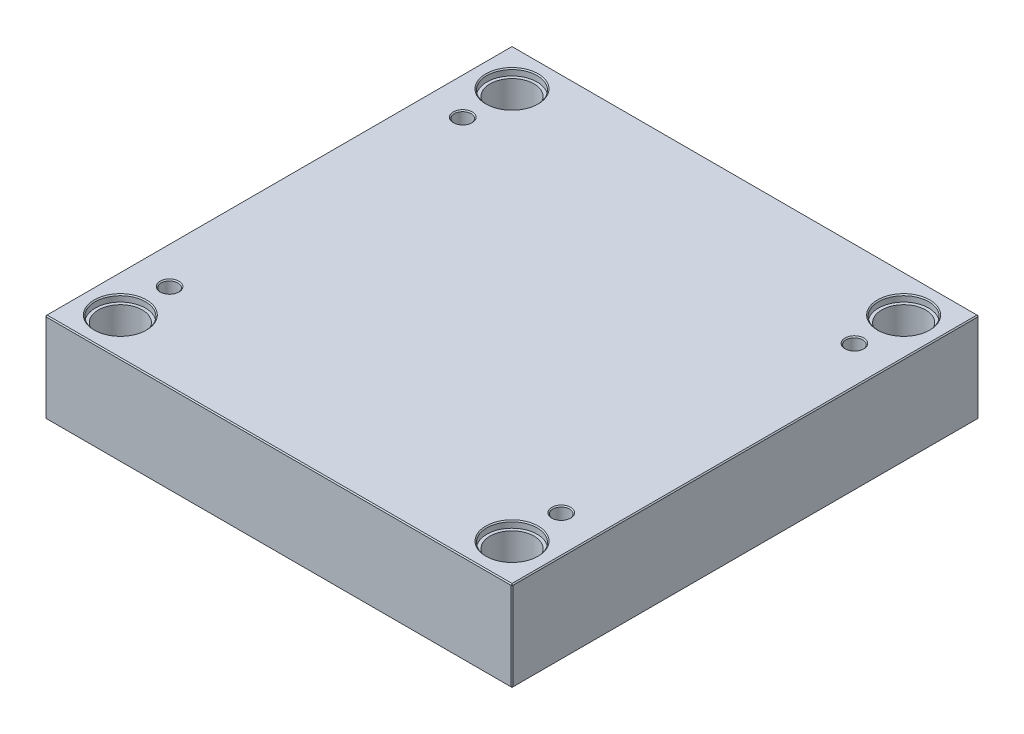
ISO-10303-21;
HEADER;
FILE_DESCRIPTION(('STEP AP214'),'2;1');
FILE_NAME('part.step','',(''),(''),'','','');
FILE_SCHEMA(('AUTOMOTIVE_DESIGN { 1 0 10303 214 1 1 1 1 }'));
ENDSEC;
DATA;
#1=APPLICATION_CONTEXT('core data for automotive mechanical design processes');
#2=APPLICATION_PROTOCOL_DEFINITION('international standard','automotive_design',2000,#1);
#3=PRODUCT_CONTEXT('',#1,'mechanical');
#4=PRODUCT('Part','Part','',(#3));
#5=PRODUCT_RELATED_PRODUCT_CATEGORY('part','',(#4));
#6=PRODUCT_DEFINITION_FORMATION('','',#4);
#7=PRODUCT_DEFINITION_CONTEXT('part definition',#1,'design');
#8=PRODUCT_DEFINITION('design','',#6,#7);
#9=PRODUCT_DEFINITION_SHAPE('','',#8);
#10=(LENGTH_UNIT() NAMED_UNIT(*) SI_UNIT(.MILLI.,.METRE.));
#11=(NAMED_UNIT(*) PLANE_ANGLE_UNIT() SI_UNIT($,.RADIAN.));
#12=(NAMED_UNIT(*) SI_UNIT($,.STERADIAN.) SOLID_ANGLE_UNIT());
#13=UNCERTAINTY_MEASURE_WITH_UNIT(LENGTH_MEASURE(1.E-05),#10,'distance_accuracy_value','');
#14=(GEOMETRIC_REPRESENTATION_CONTEXT(3) GLOBAL_UNCERTAINTY_ASSIGNED_CONTEXT((#13)) GLOBAL_UNIT_ASSIGNED_CONTEXT((#10,
#11,#12)) REPRESENTATION_CONTEXT('',''));
#15=CARTESIAN_POINT('',(0.,0.,0.));
#16=DIRECTION('',(0.,0.,1.));
#17=DIRECTION('',(1.,0.,0.));
#18=AXIS2_PLACEMENT_3D('',#15,#16,#17);
#19=CARTESIAN_POINT('',(-187.,0.,-187.));
#20=DIRECTION('',(0.,1.,0.));
#21=DIRECTION('',(0.,0.,1.));
#22=AXIS2_PLACEMENT_3D('',#19,#20,#21);
#23=CYLINDRICAL_SURFACE('',#22,21.);
#24=CARTESIAN_POINT('',(-187.,0.999999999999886,-187.));
#25=DIRECTION('',(0.,1.,0.));
#26=DIRECTION('',(0.,0.,1.));
#27=AXIS2_PLACEMENT_3D('',#24,#25,#26);
#28=CIRCLE('',#27,21.);
#29=CARTESIAN_POINT('',(-187.,0.999999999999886,-166.));
#30=VERTEX_POINT('',#29);
#31=EDGE_CURVE('E472',#30,#30,#28,.F.);
#32=ORIENTED_EDGE('',*,*,#31,.T.);
#33=EDGE_LOOP('',(#32));
#34=FACE_BOUND('',#33,.T.);
#35=CARTESIAN_POINT('',(-187.,79.7,-187.));
#36=DIRECTION('',(0.,1.,0.));
#37=DIRECTION('',(0.,0.,1.));
#38=AXIS2_PLACEMENT_3D('',#35,#36,#37);
#39=CIRCLE('',#38,21.);
#40=CARTESIAN_POINT('',(-187.,79.7,-166.));
#41=VERTEX_POINT('',#40);
#42=EDGE_CURVE('E221',#41,#41,#39,.F.);
#43=ORIENTED_EDGE('',*,*,#42,.F.);
#44=EDGE_LOOP('',(#43));
#45=FACE_BOUND('',#44,.T.);
#46=ADVANCED_FACE('F16',(#34,#45),#23,.F.);
#47=CARTESIAN_POINT('',(187.,0.,-187.));
#48=DIRECTION('',(0.,1.,0.));
#49=DIRECTION('',(0.,0.,1.));
#50=AXIS2_PLACEMENT_3D('',#47,#48,#49);
#51=CYLINDRICAL_SURFACE('',#50,21.);
#52=CARTESIAN_POINT('',(187.,0.999999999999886,-187.));
#53=DIRECTION('',(0.,1.,0.));
#54=DIRECTION('',(0.,0.,1.));
#55=AXIS2_PLACEMENT_3D('',#52,#53,#54);
#56=CIRCLE('',#55,21.);
#57=CARTESIAN_POINT('',(187.,0.999999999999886,-166.));
#58=VERTEX_POINT('',#57);
#59=EDGE_CURVE('E474',#58,#58,#56,.F.);
#60=ORIENTED_EDGE('',*,*,#59,.T.);
#61=EDGE_LOOP('',(#60));
#62=FACE_BOUND('',#61,.T.);
#63=CARTESIAN_POINT('',(187.,79.7,-187.));
#64=DIRECTION('',(0.,1.,0.));
#65=DIRECTION('',(0.,0.,1.));
#66=AXIS2_PLACEMENT_3D('',#63,#64,#65);
#67=CIRCLE('',#66,21.);
#68=CARTESIAN_POINT('',(187.,79.7,-166.));
#69=VERTEX_POINT('',#68);
#70=EDGE_CURVE('E218',#69,#69,#67,.F.);
#71=ORIENTED_EDGE('',*,*,#70,.F.);
#72=EDGE_LOOP('',(#71));
#73=FACE_BOUND('',#72,.T.);
#74=ADVANCED_FACE('F263',(#62,#73),#51,.F.);
#75=CARTESIAN_POINT('',(187.,0.,187.));
#76=DIRECTION('',(0.,1.,0.));
#77=DIRECTION('',(0.,0.,1.));
#78=AXIS2_PLACEMENT_3D('',#75,#76,#77);
#79=CYLINDRICAL_SURFACE('',#78,21.);
#80=CARTESIAN_POINT('',(187.,0.999999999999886,187.));
#81=DIRECTION('',(0.,1.,0.));
#82=DIRECTION('',(0.,0.,1.));
#83=AXIS2_PLACEMENT_3D('',#80,#81,#82);
#84=CIRCLE('',#83,21.);
#85=CARTESIAN_POINT('',(187.,0.999999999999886,208.));
#86=VERTEX_POINT('',#85);
#87=EDGE_CURVE('E477',#86,#86,#84,.F.);
#88=ORIENTED_EDGE('',*,*,#87,.T.);
#89=EDGE_LOOP('',(#88));
#90=FACE_BOUND('',#89,.T.);
#91=CARTESIAN_POINT('',(187.,79.7,187.));
#92=DIRECTION('',(0.,1.,0.));
#93=DIRECTION('',(0.,0.,1.));
#94=AXIS2_PLACEMENT_3D('',#91,#92,#93);
#95=CIRCLE('',#94,21.);
#96=CARTESIAN_POINT('',(187.,79.7,208.));
#97=VERTEX_POINT('',#96);
#98=EDGE_CURVE('E214',#97,#97,#95,.F.);
#99=ORIENTED_EDGE('',*,*,#98,.F.);
#100=EDGE_LOOP('',(#99));
#101=FACE_BOUND('',#100,.T.);
#102=ADVANCED_FACE('F270',(#90,#101),#79,.F.);
#103=CARTESIAN_POINT('',(-187.,0.,187.));
#104=DIRECTION('',(0.,1.,0.));
#105=DIRECTION('',(0.,0.,1.));
#106=AXIS2_PLACEMENT_3D('',#103,#104,#105);
#107=CYLINDRICAL_SURFACE('',#106,21.);
#108=CARTESIAN_POINT('',(-187.,0.999999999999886,187.));
#109=DIRECTION('',(0.,1.,0.));
#110=DIRECTION('',(0.,0.,1.));
#111=AXIS2_PLACEMENT_3D('',#108,#109,#110);
#112=CIRCLE('',#111,21.);
#113=CARTESIAN_POINT('',(-187.,0.999999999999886,208.));
#114=VERTEX_POINT('',#113);
#115=EDGE_CURVE('E480',#114,#114,#112,.F.);
#116=ORIENTED_EDGE('',*,*,#115,.T.);
#117=EDGE_LOOP('',(#116));
#118=FACE_BOUND('',#117,.T.);
#119=CARTESIAN_POINT('',(-187.,79.7,187.));
#120=DIRECTION('',(0.,1.,0.));
#121=DIRECTION('',(0.,0.,1.));
#122=AXIS2_PLACEMENT_3D('',#119,#120,#121);
#123=CIRCLE('',#122,21.);
#124=CARTESIAN_POINT('',(-187.,79.7,208.));
#125=VERTEX_POINT('',#124);
#126=EDGE_CURVE('E211',#125,#125,#123,.F.);
#127=ORIENTED_EDGE('',*,*,#126,.F.);
#128=EDGE_LOOP('',(#127));
#129=FACE_BOUND('',#128,.T.);
#130=ADVANCED_FACE('F277',(#118,#129),#107,.F.);
#131=CARTESIAN_POINT('',(-223.,86.,223.));
#132=DIRECTION('',(1.,0.,0.));
#133=DIRECTION('',(0.,0.,-1.));
#134=AXIS2_PLACEMENT_3D('',#131,#132,#133);
#135=PLANE('',#134);
#136=DIRECTION('',(0.,-1.,0.));
#137=VECTOR('',#136,1.);
#138=CARTESIAN_POINT('',(-223.,86.,-222.));
#139=LINE('',#138,#137);
#140=CARTESIAN_POINT('',(-223.,85.,-222.));
#141=VERTEX_POINT('',#140);
#142=CARTESIAN_POINT('',(-223.,0.99999999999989,-222.));
#143=VERTEX_POINT('',#142);
#144=EDGE_CURVE('E487',#141,#143,#139,.T.);
#145=ORIENTED_EDGE('',*,*,#144,.T.);
#146=DIRECTION('',(0.,0.,1.));
#147=VECTOR('',#146,1.);
#148=CARTESIAN_POINT('',(-223.,0.99999999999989,223.));
#149=LINE('',#148,#147);
#150=CARTESIAN_POINT('',(-223.,0.99999999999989,222.));
#151=VERTEX_POINT('',#150);
#152=EDGE_CURVE('E490',#143,#151,#149,.T.);
#153=ORIENTED_EDGE('',*,*,#152,.T.);
#154=DIRECTION('',(0.,1.,0.));
#155=VECTOR('',#154,1.);
#156=CARTESIAN_POINT('',(-223.,86.,222.));
#157=LINE('',#156,#155);
#158=CARTESIAN_POINT('',(-223.,85.,222.));
#159=VERTEX_POINT('',#158);
#160=EDGE_CURVE('E485',#151,#159,#157,.T.);
#161=ORIENTED_EDGE('',*,*,#160,.T.);
#162=DIRECTION('',(0.,0.,-1.));
#163=VECTOR('',#162,1.);
#164=CARTESIAN_POINT('',(-223.,85.,-223.));
#165=LINE('',#164,#163);
#166=EDGE_CURVE('E483',#159,#141,#165,.T.);
#167=ORIENTED_EDGE('',*,*,#166,.T.);
#168=EDGE_LOOP('',(#145,#153,#161,#167));
#169=FACE_BOUND('',#168,.T.);
#170=ADVANCED_FACE('F298',(#169),#135,.F.);
#171=CARTESIAN_POINT('',(223.,86.,223.));
#172=DIRECTION('',(0.,0.,-1.));
#173=DIRECTION('',(-1.,0.,0.));
#174=AXIS2_PLACEMENT_3D('',#171,#172,#173);
#175=PLANE('',#174);
#176=DIRECTION('',(-1.,0.,0.));
#177=VECTOR('',#176,1.);
#178=CARTESIAN_POINT('',(-223.,85.,223.));
#179=LINE('',#178,#177);
#180=CARTESIAN_POINT('',(222.,85.,223.));
#181=VERTEX_POINT('',#180);
#182=CARTESIAN_POINT('',(-222.,85.,223.));
#183=VERTEX_POINT('',#182);
#184=EDGE_CURVE('E509',#181,#183,#179,.T.);
#185=ORIENTED_EDGE('',*,*,#184,.T.);
#186=DIRECTION('',(0.,-1.,0.));
#187=VECTOR('',#186,1.);
#188=CARTESIAN_POINT('',(-222.,86.,223.));
#189=LINE('',#188,#187);
#190=CARTESIAN_POINT('',(-222.,0.99999999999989,223.));
#191=VERTEX_POINT('',#190);
#192=EDGE_CURVE('E515',#183,#191,#189,.T.);
#193=ORIENTED_EDGE('',*,*,#192,.T.);
#194=DIRECTION('',(1.,0.,0.));
#195=VECTOR('',#194,1.);
#196=CARTESIAN_POINT('',(223.,0.99999999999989,223.));
#197=LINE('',#196,#195);
#198=CARTESIAN_POINT('',(222.,0.99999999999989,223.));
#199=VERTEX_POINT('',#198);
#200=EDGE_CURVE('E513',#191,#199,#197,.T.);
#201=ORIENTED_EDGE('',*,*,#200,.T.);
#202=DIRECTION('',(0.,1.,0.));
#203=VECTOR('',#202,1.);
#204=CARTESIAN_POINT('',(222.,86.,223.));
#205=LINE('',#204,#203);
#206=EDGE_CURVE('E511',#199,#181,#205,.T.);
#207=ORIENTED_EDGE('',*,*,#206,.T.);
#208=EDGE_LOOP('',(#185,#193,#201,#207));
#209=FACE_BOUND('',#208,.T.);
#210=ADVANCED_FACE('F294',(#209),#175,.F.);
#211=CARTESIAN_POINT('',(223.,86.,223.));
#212=DIRECTION('',(-1.,0.,0.));
#213=DIRECTION('',(0.,0.,1.));
#214=AXIS2_PLACEMENT_3D('',#211,#212,#213);
#215=PLANE('',#214);
#216=DIRECTION('',(0.,0.,-1.));
#217=VECTOR('',#216,1.);
#218=CARTESIAN_POINT('',(223.,0.99999999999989,223.));
#219=LINE('',#218,#217);
#220=CARTESIAN_POINT('',(223.,0.99999999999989,222.));
#221=VERTEX_POINT('',#220);
#222=CARTESIAN_POINT('',(223.,0.99999999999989,-222.));
#223=VERTEX_POINT('',#222);
#224=EDGE_CURVE('E504',#221,#223,#219,.T.);
#225=ORIENTED_EDGE('',*,*,#224,.T.);
#226=DIRECTION('',(0.,1.,0.));
#227=VECTOR('',#226,1.);
#228=CARTESIAN_POINT('',(223.,86.,-222.));
#229=LINE('',#228,#227);
#230=CARTESIAN_POINT('',(223.,85.,-222.));
#231=VERTEX_POINT('',#230);
#232=EDGE_CURVE('E506',#223,#231,#229,.T.);
#233=ORIENTED_EDGE('',*,*,#232,.T.);
#234=DIRECTION('',(0.,0.,1.));
#235=VECTOR('',#234,1.);
#236=CARTESIAN_POINT('',(223.,85.,223.));
#237=LINE('',#236,#235);
#238=CARTESIAN_POINT('',(223.,85.,222.));
#239=VERTEX_POINT('',#238);
#240=EDGE_CURVE('E500',#231,#239,#237,.T.);
#241=ORIENTED_EDGE('',*,*,#240,.T.);
#242=DIRECTION('',(0.,-1.,0.));
#243=VECTOR('',#242,1.);
#244=CARTESIAN_POINT('',(223.,86.,222.));
#245=LINE('',#244,#243);
#246=EDGE_CURVE('E502',#239,#221,#245,.T.);
#247=ORIENTED_EDGE('',*,*,#246,.T.);
#248=EDGE_LOOP('',(#225,#233,#241,#247));
#249=FACE_BOUND('',#248,.T.);
#250=ADVANCED_FACE('F290',(#249),#215,.F.);
#251=CARTESIAN_POINT('',(223.,86.,-223.));
#252=DIRECTION('',(0.,0.,1.));
#253=DIRECTION('',(1.,0.,0.));
#254=AXIS2_PLACEMENT_3D('',#251,#252,#253);
#255=PLANE('',#254);
#256=DIRECTION('',(0.,-1.,0.));
#257=VECTOR('',#256,1.);
#258=CARTESIAN_POINT('',(222.,86.,-223.));
#259=LINE('',#258,#257);
#260=CARTESIAN_POINT('',(222.,85.,-223.));
#261=VERTEX_POINT('',#260);
#262=CARTESIAN_POINT('',(222.,0.99999999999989,-223.));
#263=VERTEX_POINT('',#262);
#264=EDGE_CURVE('E494',#261,#263,#259,.T.);
#265=ORIENTED_EDGE('',*,*,#264,.T.);
#266=DIRECTION('',(-1.,0.,0.));
#267=VECTOR('',#266,1.);
#268=CARTESIAN_POINT('',(223.,0.99999999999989,-223.));
#269=LINE('',#268,#267);
#270=CARTESIAN_POINT('',(-222.,0.99999999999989,-223.));
#271=VERTEX_POINT('',#270);
#272=EDGE_CURVE('E138',#263,#271,#269,.T.);
#273=ORIENTED_EDGE('',*,*,#272,.T.);
#274=DIRECTION('',(0.,1.,0.));
#275=VECTOR('',#274,1.);
#276=CARTESIAN_POINT('',(-222.,86.,-223.));
#277=LINE('',#276,#275);
#278=CARTESIAN_POINT('',(-222.,85.,-223.));
#279=VERTEX_POINT('',#278);
#280=EDGE_CURVE('E496',#271,#279,#277,.T.);
#281=ORIENTED_EDGE('',*,*,#280,.T.);
#282=DIRECTION('',(1.,0.,0.));
#283=VECTOR('',#282,1.);
#284=CARTESIAN_POINT('',(223.,85.,-223.));
#285=LINE('',#284,#283);
#286=EDGE_CURVE('E492',#279,#261,#285,.T.);
#287=ORIENTED_EDGE('',*,*,#286,.T.);
#288=EDGE_LOOP('',(#265,#273,#281,#287));
#289=FACE_BOUND('',#288,.T.);
#290=ADVANCED_FACE('F282',(#289),#255,.F.);
#291=CARTESIAN_POINT('',(0.,86.,0.));
#292=DIRECTION('',(0.,1.,0.));
#293=DIRECTION('',(0.,0.,1.));
#294=AXIS2_PLACEMENT_3D('',#291,#292,#293);
#295=PLANE('',#294);
#296=CARTESIAN_POINT('',(187.,86.,187.));
#297=DIRECTION('',(0.,1.,0.));
#298=DIRECTION('',(0.,0.,1.));
#299=AXIS2_PLACEMENT_3D('',#296,#297,#298);
#300=CIRCLE('',#299,25.);
#301=CARTESIAN_POINT('',(187.,86.,212.));
#302=VERTEX_POINT('',#301);
#303=EDGE_CURVE('E236',#302,#302,#300,.F.);
#304=ORIENTED_EDGE('',*,*,#303,.T.);
#305=EDGE_LOOP('',(#304));
#306=FACE_BOUND('',#305,.T.);
#307=CARTESIAN_POINT('',(-187.,86.,187.));
#308=DIRECTION('',(0.,1.,0.));
#309=DIRECTION('',(0.,0.,1.));
#310=AXIS2_PLACEMENT_3D('',#307,#308,#309);
#311=CIRCLE('',#310,25.);
#312=CARTESIAN_POINT('',(-187.,86.,212.));
#313=VERTEX_POINT('',#312);
#314=EDGE_CURVE('E233',#313,#313,#311,.F.);
#315=ORIENTED_EDGE('',*,*,#314,.T.);
#316=EDGE_LOOP('',(#315));
#317=FACE_BOUND('',#316,.T.);
#318=CARTESIAN_POINT('',(187.,86.,-187.));
#319=DIRECTION('',(0.,1.,0.));
#320=DIRECTION('',(0.,0.,1.));
#321=AXIS2_PLACEMENT_3D('',#318,#319,#320);
#322=CIRCLE('',#321,25.);
#323=CARTESIAN_POINT('',(187.,86.,-162.));
#324=VERTEX_POINT('',#323);
#325=EDGE_CURVE('E230',#324,#324,#322,.F.);
#326=ORIENTED_EDGE('',*,*,#325,.T.);
#327=EDGE_LOOP('',(#326));
#328=FACE_BOUND('',#327,.T.);
#329=CARTESIAN_POINT('',(-187.,86.,-187.));
#330=DIRECTION('',(0.,1.,0.));
#331=DIRECTION('',(0.,0.,1.));
#332=AXIS2_PLACEMENT_3D('',#329,#330,#331);
#333=CIRCLE('',#332,25.);
#334=CARTESIAN_POINT('',(-187.,86.,-162.));
#335=VERTEX_POINT('',#334);
#336=EDGE_CURVE('E227',#335,#335,#333,.F.);
#337=ORIENTED_EDGE('',*,*,#336,.T.);
#338=EDGE_LOOP('',(#337));
#339=FACE_BOUND('',#338,.T.);
#340=CARTESIAN_POINT('',(-187.,86.,140.));
#341=DIRECTION('',(0.,1.,0.));
#342=DIRECTION('',(0.,0.,1.));
#343=AXIS2_PLACEMENT_3D('',#340,#341,#342);
#344=CIRCLE('',#343,9.);
#345=CARTESIAN_POINT('',(-187.,86.,149.));
#346=VERTEX_POINT('',#345);
#347=EDGE_CURVE('E198',#346,#346,#344,.F.);
#348=ORIENTED_EDGE('',*,*,#347,.T.);
#349=EDGE_LOOP('',(#348));
#350=FACE_BOUND('',#349,.T.);
#351=CARTESIAN_POINT('',(187.,86.,140.));
#352=DIRECTION('',(0.,1.,0.));
#353=DIRECTION('',(0.,0.,1.));
#354=AXIS2_PLACEMENT_3D('',#351,#352,#353);
#355=CIRCLE('',#354,9.);
#356=CARTESIAN_POINT('',(187.,86.,149.));
#357=VERTEX_POINT('',#356);
#358=EDGE_CURVE('E195',#357,#357,#355,.F.);
#359=ORIENTED_EDGE('',*,*,#358,.T.);
#360=EDGE_LOOP('',(#359));
#361=FACE_BOUND('',#360,.T.);
#362=CARTESIAN_POINT('',(187.,86.,-140.));
#363=DIRECTION('',(0.,1.,0.));
#364=DIRECTION('',(0.,0.,1.));
#365=AXIS2_PLACEMENT_3D('',#362,#363,#364);
#366=CIRCLE('',#365,9.);
#367=CARTESIAN_POINT('',(187.,86.,-131.));
#368=VERTEX_POINT('',#367);
#369=EDGE_CURVE('E192',#368,#368,#366,.F.);
#370=ORIENTED_EDGE('',*,*,#369,.T.);
#371=EDGE_LOOP('',(#370));
#372=FACE_BOUND('',#371,.T.);
#373=CARTESIAN_POINT('',(-187.,86.,-140.));
#374=DIRECTION('',(0.,1.,0.));
#375=DIRECTION('',(0.,0.,1.));
#376=AXIS2_PLACEMENT_3D('',#373,#374,#375);
#377=CIRCLE('',#376,8.99999999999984);
#378=CARTESIAN_POINT('',(-187.,86.,-131.));
#379=VERTEX_POINT('',#378);
#380=EDGE_CURVE('E188',#379,#379,#377,.F.);
#381=ORIENTED_EDGE('',*,*,#380,.T.);
#382=EDGE_LOOP('',(#381));
#383=FACE_BOUND('',#382,.T.);
#384=DIRECTION('',(0.,0.,-1.));
#385=VECTOR('',#384,1.);
#386=CARTESIAN_POINT('',(222.,86.,-223.));
#387=LINE('',#386,#385);
#388=CARTESIAN_POINT('',(222.,86.,222.));
#389=VERTEX_POINT('',#388);
#390=CARTESIAN_POINT('',(222.,86.,-222.));
#391=VERTEX_POINT('',#390);
#392=EDGE_CURVE('E31',#389,#391,#387,.T.);
#393=ORIENTED_EDGE('',*,*,#392,.T.);
#394=DIRECTION('',(-1.,0.,0.));
#395=VECTOR('',#394,1.);
#396=CARTESIAN_POINT('',(-223.,86.,-222.));
#397=LINE('',#396,#395);
#398=CARTESIAN_POINT('',(-222.,86.,-222.));
#399=VERTEX_POINT('',#398);
#400=EDGE_CURVE('E189',#391,#399,#397,.T.);
#401=ORIENTED_EDGE('',*,*,#400,.T.);
#402=DIRECTION('',(0.,0.,1.));
#403=VECTOR('',#402,1.);
#404=CARTESIAN_POINT('',(-222.,86.,223.));
#405=LINE('',#404,#403);
#406=CARTESIAN_POINT('',(-222.,86.,222.));
#407=VERTEX_POINT('',#406);
#408=EDGE_CURVE('E518',#399,#407,#405,.T.);
#409=ORIENTED_EDGE('',*,*,#408,.T.);
#410=DIRECTION('',(1.,0.,0.));
#411=VECTOR('',#410,1.);
#412=CARTESIAN_POINT('',(223.,86.,222.));
#413=LINE('',#412,#411);
#414=EDGE_CURVE('E36',#407,#389,#413,.T.);
#415=ORIENTED_EDGE('',*,*,#414,.T.);
#416=EDGE_LOOP('',(#393,#401,#409,#415));
#417=FACE_BOUND('',#416,.T.);
#418=ADVANCED_FACE('F279',(#306,#317,#328,#339,#350,#361,#372,#383,#417),#295,.T.);
#419=CARTESIAN_POINT('',(0.,0.,0.));
#420=DIRECTION('',(0.,1.,0.));
#421=DIRECTION('',(0.,0.,1.));
#422=AXIS2_PLACEMENT_3D('',#419,#420,#421);
#423=PLANE('',#422);
#424=CARTESIAN_POINT('',(-187.,0.,-187.));
#425=DIRECTION('',(0.,1.,0.));
#426=DIRECTION('',(0.,0.,1.));
#427=AXIS2_PLACEMENT_3D('',#424,#425,#426);
#428=CIRCLE('',#427,22.);
#429=CARTESIAN_POINT('',(-187.,0.,-165.));
#430=VERTEX_POINT('',#429);
#431=EDGE_CURVE('E469',#430,#430,#428,.T.);
#432=ORIENTED_EDGE('',*,*,#431,.T.);
#433=EDGE_LOOP('',(#432));
#434=FACE_BOUND('',#433,.T.);
#435=CARTESIAN_POINT('',(187.,0.,-187.));
#436=DIRECTION('',(0.,1.,0.));
#437=DIRECTION('',(0.,0.,1.));
#438=AXIS2_PLACEMENT_3D('',#435,#436,#437);
#439=CIRCLE('',#438,22.);
#440=CARTESIAN_POINT('',(187.,0.,-165.));
#441=VERTEX_POINT('',#440);
#442=EDGE_CURVE('E466',#441,#441,#439,.T.);
#443=ORIENTED_EDGE('',*,*,#442,.T.);
#444=EDGE_LOOP('',(#443));
#445=FACE_BOUND('',#444,.T.);
#446=CARTESIAN_POINT('',(187.,0.,187.));
#447=DIRECTION('',(0.,1.,0.));
#448=DIRECTION('',(0.,0.,1.));
#449=AXIS2_PLACEMENT_3D('',#446,#447,#448);
#450=CIRCLE('',#449,22.);
#451=CARTESIAN_POINT('',(187.,0.,209.));
#452=VERTEX_POINT('',#451);
#453=EDGE_CURVE('E463',#452,#452,#450,.T.);
#454=ORIENTED_EDGE('',*,*,#453,.T.);
#455=EDGE_LOOP('',(#454));
#456=FACE_BOUND('',#455,.T.);
#457=CARTESIAN_POINT('',(-187.,0.,187.));
#458=DIRECTION('',(0.,1.,0.));
#459=DIRECTION('',(0.,0.,1.));
#460=AXIS2_PLACEMENT_3D('',#457,#458,#459);
#461=CIRCLE('',#460,22.);
#462=CARTESIAN_POINT('',(-187.,0.,209.));
#463=VERTEX_POINT('',#462);
#464=EDGE_CURVE('E460',#463,#463,#461,.T.);
#465=ORIENTED_EDGE('',*,*,#464,.T.);
#466=EDGE_LOOP('',(#465));
#467=FACE_BOUND('',#466,.T.);
#468=DIRECTION('',(0.,0.,1.));
#469=VECTOR('',#468,1.);
#470=CARTESIAN_POINT('',(222.,0.,0.));
#471=LINE('',#470,#469);
#472=CARTESIAN_POINT('',(222.,0.,-222.));
#473=VERTEX_POINT('',#472);
#474=CARTESIAN_POINT('',(222.,0.,222.));
#475=VERTEX_POINT('',#474);
#476=EDGE_CURVE('E108',#473,#475,#471,.T.);
#477=ORIENTED_EDGE('',*,*,#476,.T.);
#478=DIRECTION('',(-1.,0.,0.));
#479=VECTOR('',#478,1.);
#480=CARTESIAN_POINT('',(0.,0.,222.));
#481=LINE('',#480,#479);
#482=CARTESIAN_POINT('',(-222.,0.,222.));
#483=VERTEX_POINT('',#482);
#484=EDGE_CURVE('E458',#475,#483,#481,.T.);
#485=ORIENTED_EDGE('',*,*,#484,.T.);
#486=DIRECTION('',(0.,0.,-1.));
#487=VECTOR('',#486,1.);
#488=CARTESIAN_POINT('',(-222.,0.,0.));
#489=LINE('',#488,#487);
#490=CARTESIAN_POINT('',(-222.,0.,-222.));
#491=VERTEX_POINT('',#490);
#492=EDGE_CURVE('E110',#483,#491,#489,.T.);
#493=ORIENTED_EDGE('',*,*,#492,.T.);
#494=DIRECTION('',(1.,0.,0.));
#495=VECTOR('',#494,1.);
#496=CARTESIAN_POINT('',(0.,0.,-222.));
#497=LINE('',#496,#495);
#498=EDGE_CURVE('E104',#491,#473,#497,.T.);
#499=ORIENTED_EDGE('',*,*,#498,.T.);
#500=EDGE_LOOP('',(#477,#485,#493,#499));
#501=FACE_BOUND('',#500,.T.);
#502=ADVANCED_FACE('F106',(#434,#445,#456,#467,#501),#423,.F.);
#503=CARTESIAN_POINT('',(-187.,0.,-187.));
#504=DIRECTION('',(0.,-1.,0.));
#505=DIRECTION('',(0.,0.,-1.));
#506=AXIS2_PLACEMENT_3D('',#503,#504,#505);
#507=CONICAL_SURFACE('',#506,22.,0.78539816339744);
#508=ORIENTED_EDGE('',*,*,#31,.F.);
#509=EDGE_LOOP('',(#508));
#510=FACE_BOUND('',#509,.T.);
#511=ORIENTED_EDGE('',*,*,#431,.F.);
#512=EDGE_LOOP('',(#511));
#513=FACE_BOUND('',#512,.T.);
#514=ADVANCED_FACE('F286',(#510,#513),#507,.F.);
#515=CARTESIAN_POINT('',(187.,0.,-187.));
#516=DIRECTION('',(0.,-1.,0.));
#517=DIRECTION('',(0.,0.,-1.));
#518=AXIS2_PLACEMENT_3D('',#515,#516,#517);
#519=CONICAL_SURFACE('',#518,22.,0.78539816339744);
#520=ORIENTED_EDGE('',*,*,#59,.F.);
#521=EDGE_LOOP('',(#520));
#522=FACE_BOUND('',#521,.T.);
#523=ORIENTED_EDGE('',*,*,#442,.F.);
#524=EDGE_LOOP('',(#523));
#525=FACE_BOUND('',#524,.T.);
#526=ADVANCED_FACE('F305',(#522,#525),#519,.F.);
#527=CARTESIAN_POINT('',(187.,0.,187.));
#528=DIRECTION('',(0.,-1.,0.));
#529=DIRECTION('',(0.,0.,-1.));
#530=AXIS2_PLACEMENT_3D('',#527,#528,#529);
#531=CONICAL_SURFACE('',#530,22.,0.78539816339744);
#532=ORIENTED_EDGE('',*,*,#87,.F.);
#533=EDGE_LOOP('',(#532));
#534=FACE_BOUND('',#533,.T.);
#535=ORIENTED_EDGE('',*,*,#453,.F.);
#536=EDGE_LOOP('',(#535));
#537=FACE_BOUND('',#536,.T.);
#538=ADVANCED_FACE('F309',(#534,#537),#531,.F.);
#539=CARTESIAN_POINT('',(-187.,0.,187.));
#540=DIRECTION('',(0.,-1.,0.));
#541=DIRECTION('',(0.,0.,-1.));
#542=AXIS2_PLACEMENT_3D('',#539,#540,#541);
#543=CONICAL_SURFACE('',#542,22.,0.78539816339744);
#544=ORIENTED_EDGE('',*,*,#115,.F.);
#545=EDGE_LOOP('',(#544));
#546=FACE_BOUND('',#545,.T.);
#547=ORIENTED_EDGE('',*,*,#464,.F.);
#548=EDGE_LOOP('',(#547));
#549=FACE_BOUND('',#548,.T.);
#550=ADVANCED_FACE('F313',(#546,#549),#543,.F.);
#551=CARTESIAN_POINT('',(223.,86.,222.));
#552=DIRECTION('',(-0.707106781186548,0.,-0.707106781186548));
#553=DIRECTION('',(0.,-1.,0.));
#554=AXIS2_PLACEMENT_3D('',#551,#552,#553);
#555=PLANE('',#554);
#556=DIRECTION('',(-0.707106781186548,0.,0.707106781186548));
#557=VECTOR('',#556,1.);
#558=CARTESIAN_POINT('',(222.,85.,223.));
#559=LINE('',#558,#557);
#560=EDGE_CURVE('E126',#181,#239,#559,.F.);
#561=ORIENTED_EDGE('',*,*,#560,.F.);
#562=ORIENTED_EDGE('',*,*,#206,.F.);
#563=DIRECTION('',(0.707106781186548,0.,-0.707106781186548));
#564=VECTOR('',#563,1.);
#565=CARTESIAN_POINT('',(222.,0.99999999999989,223.));
#566=LINE('',#565,#564);
#567=EDGE_CURVE('E180',#221,#199,#566,.F.);
#568=ORIENTED_EDGE('',*,*,#567,.F.);
#569=ORIENTED_EDGE('',*,*,#246,.F.);
#570=EDGE_LOOP('',(#561,#562,#568,#569));
#571=FACE_BOUND('',#570,.T.);
#572=ADVANCED_FACE('F317',(#571),#555,.F.);
#573=CARTESIAN_POINT('',(222.,85.,223.));
#574=DIRECTION('',(0.577350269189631,0.577350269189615,0.577350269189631));
#575=DIRECTION('',(0.707106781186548,0.,-0.707106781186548));
#576=AXIS2_PLACEMENT_3D('',#573,#574,#575);
#577=PLANE('',#576);
#578=DIRECTION('',(0.,-0.707106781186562,0.707106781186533));
#579=VECTOR('',#578,1.);
#580=CARTESIAN_POINT('',(222.,85.,223.));
#581=LINE('',#580,#579);
#582=EDGE_CURVE('E175',#181,#389,#581,.F.);
#583=ORIENTED_EDGE('',*,*,#582,.F.);
#584=ORIENTED_EDGE('',*,*,#560,.T.);
#585=DIRECTION('',(-0.707106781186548,0.707106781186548,0.));
#586=VECTOR('',#585,1.);
#587=CARTESIAN_POINT('',(222.5,85.5,222.));
#588=LINE('',#587,#586);
#589=EDGE_CURVE('E177',#389,#239,#588,.F.);
#590=ORIENTED_EDGE('',*,*,#589,.F.);
#591=EDGE_LOOP('',(#583,#584,#590));
#592=FACE_BOUND('',#591,.T.);
#593=ADVANCED_FACE('F385',(#592),#577,.T.);
#594=CARTESIAN_POINT('',(222.,0.99999999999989,223.));
#595=DIRECTION('',(0.577350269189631,-0.577350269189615,0.577350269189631));
#596=DIRECTION('',(0.707106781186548,0.,-0.707106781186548));
#597=AXIS2_PLACEMENT_3D('',#594,#595,#596);
#598=PLANE('',#597);
#599=DIRECTION('',(-0.707106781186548,-0.707106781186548,0.));
#600=VECTOR('',#599,1.);
#601=CARTESIAN_POINT('',(222.5,0.499999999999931,222.));
#602=LINE('',#601,#600);
#603=EDGE_CURVE('E124',#221,#475,#602,.T.);
#604=ORIENTED_EDGE('',*,*,#603,.F.);
#605=ORIENTED_EDGE('',*,*,#567,.T.);
#606=DIRECTION('',(0.,0.707106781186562,0.707106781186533));
#607=VECTOR('',#606,1.);
#608=CARTESIAN_POINT('',(222.,0.99999999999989,223.));
#609=LINE('',#608,#607);
#610=EDGE_CURVE('E172',#475,#199,#609,.T.);
#611=ORIENTED_EDGE('',*,*,#610,.F.);
#612=EDGE_LOOP('',(#604,#605,#611));
#613=FACE_BOUND('',#612,.T.);
#614=ADVANCED_FACE('F381',(#613),#598,.T.);
#615=CARTESIAN_POINT('',(222.,86.,0.));
#616=DIRECTION('',(0.707106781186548,0.707106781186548,0.));
#617=DIRECTION('',(0.,0.,1.));
#618=AXIS2_PLACEMENT_3D('',#615,#616,#617);
#619=PLANE('',#618);
#620=ORIENTED_EDGE('',*,*,#589,.T.);
#621=ORIENTED_EDGE('',*,*,#240,.F.);
#622=DIRECTION('',(0.707106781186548,-0.707106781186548,0.));
#623=VECTOR('',#622,1.);
#624=CARTESIAN_POINT('',(223.,85.,-222.));
#625=LINE('',#624,#623);
#626=EDGE_CURVE('E166',#391,#231,#625,.T.);
#627=ORIENTED_EDGE('',*,*,#626,.F.);
#628=ORIENTED_EDGE('',*,*,#392,.F.);
#629=EDGE_LOOP('',(#620,#621,#627,#628));
#630=FACE_BOUND('',#629,.T.);
#631=ADVANCED_FACE('F377',(#630),#619,.T.);
#632=CARTESIAN_POINT('',(0.,86.,222.));
#633=DIRECTION('',(0.,0.707106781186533,0.707106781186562));
#634=DIRECTION('',(-1.,0.,0.));
#635=AXIS2_PLACEMENT_3D('',#632,#633,#634);
#636=PLANE('',#635);
#637=ORIENTED_EDGE('',*,*,#582,.T.);
#638=ORIENTED_EDGE('',*,*,#414,.F.);
#639=DIRECTION('',(0.,0.707106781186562,-0.707106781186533));
#640=VECTOR('',#639,1.);
#641=CARTESIAN_POINT('',(-222.,85.5,222.5));
#642=LINE('',#641,#640);
#643=EDGE_CURVE('E163',#183,#407,#642,.T.);
#644=ORIENTED_EDGE('',*,*,#643,.F.);
#645=ORIENTED_EDGE('',*,*,#184,.F.);
#646=EDGE_LOOP('',(#637,#638,#644,#645));
#647=FACE_BOUND('',#646,.T.);
#648=ADVANCED_FACE('F373',(#647),#636,.T.);
#649=CARTESIAN_POINT('',(-222.,86.,223.));
#650=DIRECTION('',(0.707106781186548,0.,-0.707106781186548));
#651=DIRECTION('',(0.,-1.,0.));
#652=AXIS2_PLACEMENT_3D('',#649,#650,#651);
#653=PLANE('',#652);
#654=DIRECTION('',(0.707106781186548,0.,0.707106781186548));
#655=VECTOR('',#654,1.);
#656=CARTESIAN_POINT('',(-222.,0.99999999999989,223.));
#657=LINE('',#656,#655);
#658=EDGE_CURVE('E157',#191,#151,#657,.F.);
#659=ORIENTED_EDGE('',*,*,#658,.F.);
#660=ORIENTED_EDGE('',*,*,#192,.F.);
#661=DIRECTION('',(-0.707106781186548,0.,-0.707106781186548));
#662=VECTOR('',#661,1.);
#663=CARTESIAN_POINT('',(-223.,85.,222.));
#664=LINE('',#663,#662);
#665=EDGE_CURVE('E160',#159,#183,#664,.F.);
#666=ORIENTED_EDGE('',*,*,#665,.F.);
#667=ORIENTED_EDGE('',*,*,#160,.F.);
#668=EDGE_LOOP('',(#659,#660,#666,#667));
#669=FACE_BOUND('',#668,.T.);
#670=ADVANCED_FACE('F369',(#669),#653,.F.);
#671=CARTESIAN_POINT('',(223.,0.99999999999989,223.));
#672=DIRECTION('',(0.,0.707106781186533,-0.707106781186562));
#673=DIRECTION('',(1.,0.,0.));
#674=AXIS2_PLACEMENT_3D('',#671,#672,#673);
#675=PLANE('',#674);
#676=ORIENTED_EDGE('',*,*,#610,.T.);
#677=ORIENTED_EDGE('',*,*,#200,.F.);
#678=DIRECTION('',(0.,-0.707106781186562,-0.707106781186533));
#679=VECTOR('',#678,1.);
#680=CARTESIAN_POINT('',(-222.,0.99999999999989,223.));
#681=LINE('',#680,#679);
#682=EDGE_CURVE('E135',#483,#191,#681,.F.);
#683=ORIENTED_EDGE('',*,*,#682,.F.);
#684=ORIENTED_EDGE('',*,*,#484,.F.);
#685=EDGE_LOOP('',(#676,#677,#683,#684));
#686=FACE_BOUND('',#685,.T.);
#687=ADVANCED_FACE('F366',(#686),#675,.F.);
#688=CARTESIAN_POINT('',(223.,0.99999999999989,223.));
#689=DIRECTION('',(-0.707106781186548,0.707106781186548,0.));
#690=DIRECTION('',(0.,0.,-1.));
#691=AXIS2_PLACEMENT_3D('',#688,#689,#690);
#692=PLANE('',#691);
#693=ORIENTED_EDGE('',*,*,#603,.T.);
#694=ORIENTED_EDGE('',*,*,#476,.F.);
#695=DIRECTION('',(0.707106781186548,0.707106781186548,0.));
#696=VECTOR('',#695,1.);
#697=CARTESIAN_POINT('',(222.5,0.499999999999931,-222.));
#698=LINE('',#697,#696);
#699=EDGE_CURVE('E121',#223,#473,#698,.F.);
#700=ORIENTED_EDGE('',*,*,#699,.F.);
#701=ORIENTED_EDGE('',*,*,#224,.F.);
#702=EDGE_LOOP('',(#693,#694,#700,#701));
#703=FACE_BOUND('',#702,.T.);
#704=ADVANCED_FACE('F119',(#703),#692,.F.);
#705=CARTESIAN_POINT('',(222.,86.,-223.));
#706=DIRECTION('',(-0.707106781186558,0.,0.707106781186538));
#707=DIRECTION('',(0.,-1.,0.));
#708=AXIS2_PLACEMENT_3D('',#705,#706,#707);
#709=PLANE('',#708);
#710=DIRECTION('',(0.707106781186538,0.,0.707106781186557));
#711=VECTOR('',#710,1.);
#712=CARTESIAN_POINT('',(223.,85.,-222.));
#713=LINE('',#712,#711);
#714=EDGE_CURVE('E168',#231,#261,#713,.F.);
#715=ORIENTED_EDGE('',*,*,#714,.F.);
#716=ORIENTED_EDGE('',*,*,#232,.F.);
#717=DIRECTION('',(-0.707106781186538,0.,-0.707106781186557));
#718=VECTOR('',#717,1.);
#719=CARTESIAN_POINT('',(222.,0.99999999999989,-223.));
#720=LINE('',#719,#718);
#721=EDGE_CURVE('E134',#263,#223,#720,.F.);
#722=ORIENTED_EDGE('',*,*,#721,.F.);
#723=ORIENTED_EDGE('',*,*,#264,.F.);
#724=EDGE_LOOP('',(#715,#716,#722,#723));
#725=FACE_BOUND('',#724,.T.);
#726=ADVANCED_FACE('F359',(#725),#709,.F.);
#727=CARTESIAN_POINT('',(223.,85.,-222.));
#728=DIRECTION('',(0.577350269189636,0.57735026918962,-0.57735026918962));
#729=DIRECTION('',(-0.707106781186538,0.,-0.707106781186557));
#730=AXIS2_PLACEMENT_3D('',#727,#728,#729);
#731=PLANE('',#730);
#732=ORIENTED_EDGE('',*,*,#626,.T.);
#733=ORIENTED_EDGE('',*,*,#714,.T.);
#734=DIRECTION('',(0.,0.707106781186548,0.707106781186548));
#735=VECTOR('',#734,1.);
#736=CARTESIAN_POINT('',(222.,85.5,-222.5));
#737=LINE('',#736,#735);
#738=EDGE_CURVE('E152',#391,#261,#737,.F.);
#739=ORIENTED_EDGE('',*,*,#738,.F.);
#740=EDGE_LOOP('',(#732,#733,#739));
#741=FACE_BOUND('',#740,.T.);
#742=ADVANCED_FACE('F355',(#741),#731,.T.);
#743=CARTESIAN_POINT('',(-223.,85.,222.));
#744=DIRECTION('',(-0.577350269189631,0.577350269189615,0.577350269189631));
#745=DIRECTION('',(0.707106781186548,0.,0.707106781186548));
#746=AXIS2_PLACEMENT_3D('',#743,#744,#745);
#747=PLANE('',#746);
#748=ORIENTED_EDGE('',*,*,#665,.T.);
#749=ORIENTED_EDGE('',*,*,#643,.T.);
#750=DIRECTION('',(-0.707106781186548,-0.707106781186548,0.));
#751=VECTOR('',#750,1.);
#752=CARTESIAN_POINT('',(-223.,85.,222.));
#753=LINE('',#752,#751);
#754=EDGE_CURVE('E143',#159,#407,#753,.F.);
#755=ORIENTED_EDGE('',*,*,#754,.F.);
#756=EDGE_LOOP('',(#748,#749,#755));
#757=FACE_BOUND('',#756,.T.);
#758=ADVANCED_FACE('F351',(#757),#747,.T.);
#759=CARTESIAN_POINT('',(-222.,0.99999999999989,223.));
#760=DIRECTION('',(-0.577350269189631,-0.577350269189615,0.577350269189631));
#761=DIRECTION('',(0.707106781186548,0.,0.707106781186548));
#762=AXIS2_PLACEMENT_3D('',#759,#760,#761);
#763=PLANE('',#762);
#764=ORIENTED_EDGE('',*,*,#682,.T.);
#765=ORIENTED_EDGE('',*,*,#658,.T.);
#766=DIRECTION('',(-0.707106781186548,0.707106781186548,0.));
#767=VECTOR('',#766,1.);
#768=CARTESIAN_POINT('',(-222.5,0.499999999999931,222.));
#769=LINE('',#768,#767);
#770=EDGE_CURVE('E139',#483,#151,#769,.T.);
#771=ORIENTED_EDGE('',*,*,#770,.F.);
#772=EDGE_LOOP('',(#764,#765,#771));
#773=FACE_BOUND('',#772,.T.);
#774=ADVANCED_FACE('F348',(#773),#763,.T.);
#775=CARTESIAN_POINT('',(222.,0.99999999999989,-223.));
#776=DIRECTION('',(0.577350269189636,-0.57735026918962,-0.57735026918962));
#777=DIRECTION('',(-0.707106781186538,0.,-0.707106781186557));
#778=AXIS2_PLACEMENT_3D('',#775,#776,#777);
#779=PLANE('',#778);
#780=ORIENTED_EDGE('',*,*,#721,.T.);
#781=ORIENTED_EDGE('',*,*,#699,.T.);
#782=DIRECTION('',(0.,-0.707106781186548,0.707106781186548));
#783=VECTOR('',#782,1.);
#784=CARTESIAN_POINT('',(222.,0.99999999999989,-223.));
#785=LINE('',#784,#783);
#786=EDGE_CURVE('E131',#263,#473,#785,.T.);
#787=ORIENTED_EDGE('',*,*,#786,.F.);
#788=EDGE_LOOP('',(#780,#781,#787));
#789=FACE_BOUND('',#788,.T.);
#790=ADVANCED_FACE('F130',(#789),#779,.T.);
#791=CARTESIAN_POINT('',(0.,86.,-222.));
#792=DIRECTION('',(0.,0.707106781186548,-0.707106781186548));
#793=DIRECTION('',(1.,0.,0.));
#794=AXIS2_PLACEMENT_3D('',#791,#792,#793);
#795=PLANE('',#794);
#796=ORIENTED_EDGE('',*,*,#738,.T.);
#797=ORIENTED_EDGE('',*,*,#286,.F.);
#798=DIRECTION('',(0.,-0.707106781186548,-0.707106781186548));
#799=VECTOR('',#798,1.);
#800=CARTESIAN_POINT('',(-222.,85.,-223.));
#801=LINE('',#800,#799);
#802=EDGE_CURVE('E140',#399,#279,#801,.T.);
#803=ORIENTED_EDGE('',*,*,#802,.F.);
#804=ORIENTED_EDGE('',*,*,#400,.F.);
#805=EDGE_LOOP('',(#796,#797,#803,#804));
#806=FACE_BOUND('',#805,.T.);
#807=ADVANCED_FACE('F341',(#806),#795,.T.);
#808=CARTESIAN_POINT('',(-222.,86.,0.));
#809=DIRECTION('',(-0.707106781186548,0.707106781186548,0.));
#810=DIRECTION('',(0.,0.,-1.));
#811=AXIS2_PLACEMENT_3D('',#808,#809,#810);
#812=PLANE('',#811);
#813=ORIENTED_EDGE('',*,*,#754,.T.);
#814=ORIENTED_EDGE('',*,*,#408,.F.);
#815=DIRECTION('',(0.707106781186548,0.707106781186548,0.));
#816=VECTOR('',#815,1.);
#817=CARTESIAN_POINT('',(-222.5,85.5,-222.));
#818=LINE('',#817,#816);
#819=EDGE_CURVE('E146',#141,#399,#818,.T.);
#820=ORIENTED_EDGE('',*,*,#819,.F.);
#821=ORIENTED_EDGE('',*,*,#166,.F.);
#822=EDGE_LOOP('',(#813,#814,#820,#821));
#823=FACE_BOUND('',#822,.T.);
#824=ADVANCED_FACE('F337',(#823),#812,.T.);
#825=CARTESIAN_POINT('',(-223.,0.99999999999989,223.));
#826=DIRECTION('',(0.707106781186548,0.707106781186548,0.));
#827=DIRECTION('',(0.,0.,1.));
#828=AXIS2_PLACEMENT_3D('',#825,#826,#827);
#829=PLANE('',#828);
#830=ORIENTED_EDGE('',*,*,#770,.T.);
#831=ORIENTED_EDGE('',*,*,#152,.F.);
#832=DIRECTION('',(0.707106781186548,-0.707106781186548,0.));
#833=VECTOR('',#832,1.);
#834=CARTESIAN_POINT('',(-223.,0.99999999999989,-222.));
#835=LINE('',#834,#833);
#836=EDGE_CURVE('E529',#491,#143,#835,.F.);
#837=ORIENTED_EDGE('',*,*,#836,.F.);
#838=ORIENTED_EDGE('',*,*,#492,.F.);
#839=EDGE_LOOP('',(#830,#831,#837,#838));
#840=FACE_BOUND('',#839,.T.);
#841=ADVANCED_FACE('F334',(#840),#829,.F.);
#842=CARTESIAN_POINT('',(223.,0.99999999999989,-223.));
#843=DIRECTION('',(0.,0.707106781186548,0.707106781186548));
#844=DIRECTION('',(-1.,0.,0.));
#845=AXIS2_PLACEMENT_3D('',#842,#843,#844);
#846=PLANE('',#845);
#847=ORIENTED_EDGE('',*,*,#786,.T.);
#848=ORIENTED_EDGE('',*,*,#498,.F.);
#849=DIRECTION('',(0.,0.707106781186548,-0.707106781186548));
#850=VECTOR('',#849,1.);
#851=CARTESIAN_POINT('',(-222.,0.499999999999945,-222.5));
#852=LINE('',#851,#850);
#853=EDGE_CURVE('E526',#271,#491,#852,.F.);
#854=ORIENTED_EDGE('',*,*,#853,.F.);
#855=ORIENTED_EDGE('',*,*,#272,.F.);
#856=EDGE_LOOP('',(#847,#848,#854,#855));
#857=FACE_BOUND('',#856,.T.);
#858=ADVANCED_FACE('F137',(#857),#846,.F.);
#859=CARTESIAN_POINT('',(-222.,85.,-223.));
#860=DIRECTION('',(-0.577350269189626,0.577350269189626,-0.577350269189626));
#861=DIRECTION('',(-0.707106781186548,0.,0.707106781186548));
#862=AXIS2_PLACEMENT_3D('',#859,#860,#861);
#863=PLANE('',#862);
#864=ORIENTED_EDGE('',*,*,#819,.T.);
#865=ORIENTED_EDGE('',*,*,#802,.T.);
#866=DIRECTION('',(0.707106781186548,0.,-0.707106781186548));
#867=VECTOR('',#866,1.);
#868=CARTESIAN_POINT('',(-222.,85.,-223.));
#869=LINE('',#868,#867);
#870=EDGE_CURVE('E524',#141,#279,#869,.T.);
#871=ORIENTED_EDGE('',*,*,#870,.F.);
#872=EDGE_LOOP('',(#864,#865,#871));
#873=FACE_BOUND('',#872,.T.);
#874=ADVANCED_FACE('F327',(#873),#863,.T.);
#875=CARTESIAN_POINT('',(-223.,0.99999999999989,-222.));
#876=DIRECTION('',(-0.577350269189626,-0.577350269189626,-0.577350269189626));
#877=DIRECTION('',(-0.707106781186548,0.,0.707106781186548));
#878=AXIS2_PLACEMENT_3D('',#875,#876,#877);
#879=PLANE('',#878);
#880=ORIENTED_EDGE('',*,*,#853,.T.);
#881=ORIENTED_EDGE('',*,*,#836,.T.);
#882=DIRECTION('',(-0.707106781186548,0.,0.707106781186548));
#883=VECTOR('',#882,1.);
#884=CARTESIAN_POINT('',(-223.,0.99999999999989,-222.));
#885=LINE('',#884,#883);
#886=EDGE_CURVE('E455',#271,#143,#885,.T.);
#887=ORIENTED_EDGE('',*,*,#886,.F.);
#888=EDGE_LOOP('',(#880,#881,#887));
#889=FACE_BOUND('',#888,.T.);
#890=ADVANCED_FACE('F323',(#889),#879,.T.);
#891=CARTESIAN_POINT('',(-223.,86.,-222.));
#892=DIRECTION('',(0.707106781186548,0.,0.707106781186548));
#893=DIRECTION('',(0.,-1.,0.));
#894=AXIS2_PLACEMENT_3D('',#891,#892,#893);
#895=PLANE('',#894);
#896=ORIENTED_EDGE('',*,*,#870,.T.);
#897=ORIENTED_EDGE('',*,*,#280,.F.);
#898=ORIENTED_EDGE('',*,*,#886,.T.);
#899=ORIENTED_EDGE('',*,*,#144,.F.);
#900=EDGE_LOOP('',(#896,#897,#898,#899));
#901=FACE_BOUND('',#900,.T.);
#902=ADVANCED_FACE('F319',(#901),#895,.F.);
#903=CARTESIAN_POINT('',(-187.,61.,-140.));
#904=DIRECTION('',(0.,1.,0.));
#905=DIRECTION('',(0.,0.,1.));
#906=AXIS2_PLACEMENT_3D('',#903,#904,#905);
#907=CYLINDRICAL_SURFACE('',#906,8.);
#908=CARTESIAN_POINT('',(-187.,85.,-140.));
#909=DIRECTION('',(0.,1.,0.));
#910=DIRECTION('',(0.,0.,1.));
#911=AXIS2_PLACEMENT_3D('',#908,#909,#910);
#912=CIRCLE('',#911,8.);
#913=CARTESIAN_POINT('',(-187.,85.,-132.));
#914=VERTEX_POINT('',#913);
#915=EDGE_CURVE('E207',#914,#914,#912,.T.);
#916=ORIENTED_EDGE('',*,*,#915,.T.);
#917=EDGE_LOOP('',(#916));
#918=FACE_BOUND('',#917,.T.);
#919=CARTESIAN_POINT('',(-187.,61.,-140.));
#920=DIRECTION('',(0.,1.,0.));
#921=DIRECTION('',(0.,0.,1.));
#922=AXIS2_PLACEMENT_3D('',#919,#920,#921);
#923=CIRCLE('',#922,8.);
#924=CARTESIAN_POINT('',(-187.,61.,-132.));
#925=VERTEX_POINT('',#924);
#926=EDGE_CURVE('E448',#925,#925,#923,.T.);
#927=ORIENTED_EDGE('',*,*,#926,.F.);
#928=EDGE_LOOP('',(#927));
#929=FACE_BOUND('',#928,.T.);
#930=ADVANCED_FACE('F322',(#918,#929),#907,.F.);
#931=CARTESIAN_POINT('',(-187.,61.,-140.));
#932=DIRECTION('',(0.,1.,0.));
#933=DIRECTION('',(0.,0.,1.));
#934=AXIS2_PLACEMENT_3D('',#931,#932,#933);
#935=PLANE('',#934);
#936=ORIENTED_EDGE('',*,*,#926,.T.);
#937=EDGE_LOOP('',(#936));
#938=FACE_BOUND('',#937,.T.);
#939=ADVANCED_FACE('F596',(#938),#935,.T.);
#940=CARTESIAN_POINT('',(187.,61.,-140.));
#941=DIRECTION('',(0.,1.,0.));
#942=DIRECTION('',(0.,0.,1.));
#943=AXIS2_PLACEMENT_3D('',#940,#941,#942);
#944=CYLINDRICAL_SURFACE('',#943,8.);
#945=CARTESIAN_POINT('',(187.,85.,-140.));
#946=DIRECTION('',(0.,1.,0.));
#947=DIRECTION('',(0.,0.,1.));
#948=AXIS2_PLACEMENT_3D('',#945,#946,#947);
#949=CIRCLE('',#948,8.);
#950=CARTESIAN_POINT('',(187.,85.,-132.));
#951=VERTEX_POINT('',#950);
#952=EDGE_CURVE('E204',#951,#951,#949,.T.);
#953=ORIENTED_EDGE('',*,*,#952,.T.);
#954=EDGE_LOOP('',(#953));
#955=FACE_BOUND('',#954,.T.);
#956=CARTESIAN_POINT('',(187.,61.,-140.));
#957=DIRECTION('',(0.,1.,0.));
#958=DIRECTION('',(0.,0.,1.));
#959=AXIS2_PLACEMENT_3D('',#956,#957,#958);
#960=CIRCLE('',#959,8.);
#961=CARTESIAN_POINT('',(187.,61.,-132.));
#962=VERTEX_POINT('',#961);
#963=EDGE_CURVE('E445',#962,#962,#960,.T.);
#964=ORIENTED_EDGE('',*,*,#963,.F.);
#965=EDGE_LOOP('',(#964));
#966=FACE_BOUND('',#965,.T.);
#967=ADVANCED_FACE('F592',(#955,#966),#944,.F.);
#968=CARTESIAN_POINT('',(187.,61.,-140.));
#969=DIRECTION('',(0.,1.,0.));
#970=DIRECTION('',(0.,0.,1.));
#971=AXIS2_PLACEMENT_3D('',#968,#969,#970);
#972=PLANE('',#971);
#973=ORIENTED_EDGE('',*,*,#963,.T.);
#974=EDGE_LOOP('',(#973));
#975=FACE_BOUND('',#974,.T.);
#976=ADVANCED_FACE('F588',(#975),#972,.T.);
#977=CARTESIAN_POINT('',(187.,61.,140.));
#978=DIRECTION('',(0.,1.,0.));
#979=DIRECTION('',(0.,0.,1.));
#980=AXIS2_PLACEMENT_3D('',#977,#978,#979);
#981=CYLINDRICAL_SURFACE('',#980,8.);
#982=CARTESIAN_POINT('',(187.,85.,140.));
#983=DIRECTION('',(0.,1.,0.));
#984=DIRECTION('',(0.,0.,1.));
#985=AXIS2_PLACEMENT_3D('',#982,#983,#984);
#986=CIRCLE('',#985,8.);
#987=CARTESIAN_POINT('',(187.,85.,148.));
#988=VERTEX_POINT('',#987);
#989=EDGE_CURVE('E201',#988,#988,#986,.T.);
#990=ORIENTED_EDGE('',*,*,#989,.T.);
#991=EDGE_LOOP('',(#990));
#992=FACE_BOUND('',#991,.T.);
#993=CARTESIAN_POINT('',(187.,61.,140.));
#994=DIRECTION('',(0.,1.,0.));
#995=DIRECTION('',(0.,0.,1.));
#996=AXIS2_PLACEMENT_3D('',#993,#994,#995);
#997=CIRCLE('',#996,8.);
#998=CARTESIAN_POINT('',(187.,61.,148.));
#999=VERTEX_POINT('',#998);
#1000=EDGE_CURVE('E449',#999,#999,#997,.T.);
#1001=ORIENTED_EDGE('',*,*,#1000,.F.);
#1002=EDGE_LOOP('',(#1001));
#1003=FACE_BOUND('',#1002,.T.);
#1004=ADVANCED_FACE('F591',(#992,#1003),#981,.F.);
#1005=CARTESIAN_POINT('',(187.,61.,140.));
#1006=DIRECTION('',(0.,1.,0.));
#1007=DIRECTION('',(0.,0.,1.));
#1008=AXIS2_PLACEMENT_3D('',#1005,#1006,#1007);
#1009=PLANE('',#1008);
#1010=ORIENTED_EDGE('',*,*,#1000,.T.);
#1011=EDGE_LOOP('',(#1010));
#1012=FACE_BOUND('',#1011,.T.);
#1013=ADVANCED_FACE('F598',(#1012),#1009,.T.);
#1014=CARTESIAN_POINT('',(-187.,61.,140.));
#1015=DIRECTION('',(0.,1.,0.));
#1016=DIRECTION('',(0.,0.,1.));
#1017=AXIS2_PLACEMENT_3D('',#1014,#1015,#1016);
#1018=CYLINDRICAL_SURFACE('',#1017,8.);
#1019=CARTESIAN_POINT('',(-187.,85.,140.));
#1020=DIRECTION('',(0.,1.,0.));
#1021=DIRECTION('',(0.,0.,1.));
#1022=AXIS2_PLACEMENT_3D('',#1019,#1020,#1021);
#1023=CIRCLE('',#1022,8.);
#1024=CARTESIAN_POINT('',(-187.,85.,148.));
#1025=VERTEX_POINT('',#1024);
#1026=EDGE_CURVE('E185',#1025,#1025,#1023,.T.);
#1027=ORIENTED_EDGE('',*,*,#1026,.T.);
#1028=EDGE_LOOP('',(#1027));
#1029=FACE_BOUND('',#1028,.T.);
#1030=CARTESIAN_POINT('',(-187.,61.,140.));
#1031=DIRECTION('',(0.,1.,0.));
#1032=DIRECTION('',(0.,0.,1.));
#1033=AXIS2_PLACEMENT_3D('',#1030,#1031,#1032);
#1034=CIRCLE('',#1033,8.);
#1035=CARTESIAN_POINT('',(-187.,61.,148.));
#1036=VERTEX_POINT('',#1035);
#1037=EDGE_CURVE('E224',#1036,#1036,#1034,.T.);
#1038=ORIENTED_EDGE('',*,*,#1037,.F.);
#1039=EDGE_LOOP('',(#1038));
#1040=FACE_BOUND('',#1039,.T.);
#1041=ADVANCED_FACE('F601',(#1029,#1040),#1018,.F.);
#1042=CARTESIAN_POINT('',(-187.,61.,140.));
#1043=DIRECTION('',(0.,1.,0.));
#1044=DIRECTION('',(0.,0.,1.));
#1045=AXIS2_PLACEMENT_3D('',#1042,#1043,#1044);
#1046=PLANE('',#1045);
#1047=ORIENTED_EDGE('',*,*,#1037,.T.);
#1048=EDGE_LOOP('',(#1047));
#1049=FACE_BOUND('',#1048,.T.);
#1050=ADVANCED_FACE('F397',(#1049),#1046,.T.);
#1051=CARTESIAN_POINT('',(-187.,85.,140.));
#1052=DIRECTION('',(0.,1.,0.));
#1053=DIRECTION('',(0.,0.,1.));
#1054=AXIS2_PLACEMENT_3D('',#1051,#1052,#1053);
#1055=CONICAL_SURFACE('',#1054,8.,0.785398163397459);
#1056=ORIENTED_EDGE('',*,*,#347,.F.);
#1057=EDGE_LOOP('',(#1056));
#1058=FACE_BOUND('',#1057,.T.);
#1059=ORIENTED_EDGE('',*,*,#1026,.F.);
#1060=EDGE_LOOP('',(#1059));
#1061=FACE_BOUND('',#1060,.T.);
#1062=ADVANCED_FACE('F393',(#1058,#1061),#1055,.F.);
#1063=CARTESIAN_POINT('',(187.,85.,140.));
#1064=DIRECTION('',(0.,1.,0.));
#1065=DIRECTION('',(0.,0.,1.));
#1066=AXIS2_PLACEMENT_3D('',#1063,#1064,#1065);
#1067=CONICAL_SURFACE('',#1066,8.,0.785398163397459);
#1068=ORIENTED_EDGE('',*,*,#358,.F.);
#1069=EDGE_LOOP('',(#1068));
#1070=FACE_BOUND('',#1069,.T.);
#1071=ORIENTED_EDGE('',*,*,#989,.F.);
#1072=EDGE_LOOP('',(#1071));
#1073=FACE_BOUND('',#1072,.T.);
#1074=ADVANCED_FACE('F396',(#1070,#1073),#1067,.F.);
#1075=CARTESIAN_POINT('',(187.,85.,-140.));
#1076=DIRECTION('',(0.,1.,0.));
#1077=DIRECTION('',(0.,0.,1.));
#1078=AXIS2_PLACEMENT_3D('',#1075,#1076,#1077);
#1079=CONICAL_SURFACE('',#1078,8.,0.785398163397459);
#1080=ORIENTED_EDGE('',*,*,#369,.F.);
#1081=EDGE_LOOP('',(#1080));
#1082=FACE_BOUND('',#1081,.T.);
#1083=ORIENTED_EDGE('',*,*,#952,.F.);
#1084=EDGE_LOOP('',(#1083));
#1085=FACE_BOUND('',#1084,.T.);
#1086=ADVANCED_FACE('F401',(#1082,#1085),#1079,.F.);
#1087=CARTESIAN_POINT('',(-187.,85.,-140.));
#1088=DIRECTION('',(0.,1.,0.));
#1089=DIRECTION('',(0.,0.,1.));
#1090=AXIS2_PLACEMENT_3D('',#1087,#1088,#1089);
#1091=CONICAL_SURFACE('',#1090,8.,0.785398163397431);
#1092=ORIENTED_EDGE('',*,*,#380,.F.);
#1093=EDGE_LOOP('',(#1092));
#1094=FACE_BOUND('',#1093,.T.);
#1095=ORIENTED_EDGE('',*,*,#915,.F.);
#1096=EDGE_LOOP('',(#1095));
#1097=FACE_BOUND('',#1096,.T.);
#1098=ADVANCED_FACE('F405',(#1094,#1097),#1091,.F.);
#1099=CARTESIAN_POINT('',(-187.,79.7,187.));
#1100=DIRECTION('',(0.,1.,0.));
#1101=DIRECTION('',(0.,0.,1.));
#1102=AXIS2_PLACEMENT_3D('',#1099,#1100,#1101);
#1103=PLANE('',#1102);
#1104=CARTESIAN_POINT('',(-187.,79.7,187.));
#1105=DIRECTION('',(0.,1.,0.));
#1106=DIRECTION('',(0.,0.,1.));
#1107=AXIS2_PLACEMENT_3D('',#1104,#1105,#1106);
#1108=CIRCLE('',#1107,24.);
#1109=CARTESIAN_POINT('',(-187.,79.7,211.));
#1110=VERTEX_POINT('',#1109);
#1111=EDGE_CURVE('E436',#1110,#1110,#1108,.T.);
#1112=ORIENTED_EDGE('',*,*,#1111,.T.);
#1113=EDGE_LOOP('',(#1112));
#1114=FACE_BOUND('',#1113,.T.);
#1115=ORIENTED_EDGE('',*,*,#126,.T.);
#1116=EDGE_LOOP('',(#1115));
#1117=FACE_BOUND('',#1116,.T.);
#1118=ADVANCED_FACE('F409',(#1114,#1117),#1103,.T.);
#1119=CARTESIAN_POINT('',(-187.,79.7,187.));
#1120=DIRECTION('',(0.,1.,0.));
#1121=DIRECTION('',(0.,0.,1.));
#1122=AXIS2_PLACEMENT_3D('',#1119,#1120,#1121);
#1123=CYLINDRICAL_SURFACE('',#1122,24.);
#1124=CARTESIAN_POINT('',(-187.,85.,187.));
#1125=DIRECTION('',(0.,1.,0.));
#1126=DIRECTION('',(0.,0.,1.));
#1127=AXIS2_PLACEMENT_3D('',#1124,#1125,#1126);
#1128=CIRCLE('',#1127,24.);
#1129=CARTESIAN_POINT('',(-187.,85.,211.));
#1130=VERTEX_POINT('',#1129);
#1131=EDGE_CURVE('E239',#1130,#1130,#1128,.T.);
#1132=ORIENTED_EDGE('',*,*,#1131,.T.);
#1133=EDGE_LOOP('',(#1132));
#1134=FACE_BOUND('',#1133,.T.);
#1135=ORIENTED_EDGE('',*,*,#1111,.F.);
#1136=EDGE_LOOP('',(#1135));
#1137=FACE_BOUND('',#1136,.T.);
#1138=ADVANCED_FACE('F574',(#1134,#1137),#1123,.F.);
#1139=CARTESIAN_POINT('',(187.,79.7,187.));
#1140=DIRECTION('',(0.,1.,0.));
#1141=DIRECTION('',(0.,0.,1.));
#1142=AXIS2_PLACEMENT_3D('',#1139,#1140,#1141);
#1143=PLANE('',#1142);
#1144=CARTESIAN_POINT('',(187.,79.7,187.));
#1145=DIRECTION('',(0.,1.,0.));
#1146=DIRECTION('',(0.,0.,1.));
#1147=AXIS2_PLACEMENT_3D('',#1144,#1145,#1146);
#1148=CIRCLE('',#1147,24.);
#1149=CARTESIAN_POINT('',(187.,79.7,211.));
#1150=VERTEX_POINT('',#1149);
#1151=EDGE_CURVE('E433',#1150,#1150,#1148,.T.);
#1152=ORIENTED_EDGE('',*,*,#1151,.T.);
#1153=EDGE_LOOP('',(#1152));
#1154=FACE_BOUND('',#1153,.T.);
#1155=ORIENTED_EDGE('',*,*,#98,.T.);
#1156=EDGE_LOOP('',(#1155));
#1157=FACE_BOUND('',#1156,.T.);
#1158=ADVANCED_FACE('F429',(#1154,#1157),#1143,.T.);
#1159=CARTESIAN_POINT('',(187.,79.7,187.));
#1160=DIRECTION('',(0.,1.,0.));
#1161=DIRECTION('',(0.,0.,1.));
#1162=AXIS2_PLACEMENT_3D('',#1159,#1160,#1161);
#1163=CYLINDRICAL_SURFACE('',#1162,24.);
#1164=CARTESIAN_POINT('',(187.,85.,187.));
#1165=DIRECTION('',(0.,1.,0.));
#1166=DIRECTION('',(0.,0.,1.));
#1167=AXIS2_PLACEMENT_3D('',#1164,#1165,#1166);
#1168=CIRCLE('',#1167,24.);
#1169=CARTESIAN_POINT('',(187.,85.,211.));
#1170=VERTEX_POINT('',#1169);
#1171=EDGE_CURVE('E210',#1170,#1170,#1168,.T.);
#1172=ORIENTED_EDGE('',*,*,#1171,.T.);
#1173=EDGE_LOOP('',(#1172));
#1174=FACE_BOUND('',#1173,.T.);
#1175=ORIENTED_EDGE('',*,*,#1151,.F.);
#1176=EDGE_LOOP('',(#1175));
#1177=FACE_BOUND('',#1176,.T.);
#1178=ADVANCED_FACE('F425',(#1174,#1177),#1163,.F.);
#1179=CARTESIAN_POINT('',(187.,79.7,-187.));
#1180=DIRECTION('',(0.,1.,0.));
#1181=DIRECTION('',(0.,0.,1.));
#1182=AXIS2_PLACEMENT_3D('',#1179,#1180,#1181);
#1183=PLANE('',#1182);
#1184=CARTESIAN_POINT('',(187.,79.7,-187.));
#1185=DIRECTION('',(0.,1.,0.));
#1186=DIRECTION('',(0.,0.,1.));
#1187=AXIS2_PLACEMENT_3D('',#1184,#1185,#1186);
#1188=CIRCLE('',#1187,24.);
#1189=CARTESIAN_POINT('',(187.,79.7,-163.));
#1190=VERTEX_POINT('',#1189);
#1191=EDGE_CURVE('E435',#1190,#1190,#1188,.T.);
#1192=ORIENTED_EDGE('',*,*,#1191,.T.);
#1193=EDGE_LOOP('',(#1192));
#1194=FACE_BOUND('',#1193,.T.);
#1195=ORIENTED_EDGE('',*,*,#70,.T.);
#1196=EDGE_LOOP('',(#1195));
#1197=FACE_BOUND('',#1196,.T.);
#1198=ADVANCED_FACE('F428',(#1194,#1197),#1183,.T.);
#1199=CARTESIAN_POINT('',(187.,79.7,-187.));
#1200=DIRECTION('',(0.,1.,0.));
#1201=DIRECTION('',(0.,0.,1.));
#1202=AXIS2_PLACEMENT_3D('',#1199,#1200,#1201);
#1203=CYLINDRICAL_SURFACE('',#1202,24.);
#1204=CARTESIAN_POINT('',(187.,85.,-187.));
#1205=DIRECTION('',(0.,1.,0.));
#1206=DIRECTION('',(0.,0.,1.));
#1207=AXIS2_PLACEMENT_3D('',#1204,#1205,#1206);
#1208=CIRCLE('',#1207,24.);
#1209=CARTESIAN_POINT('',(187.,85.,-163.));
#1210=VERTEX_POINT('',#1209);
#1211=EDGE_CURVE('E24',#1210,#1210,#1208,.T.);
#1212=ORIENTED_EDGE('',*,*,#1211,.T.);
#1213=EDGE_LOOP('',(#1212));
#1214=FACE_BOUND('',#1213,.T.);
#1215=ORIENTED_EDGE('',*,*,#1191,.F.);
#1216=EDGE_LOOP('',(#1215));
#1217=FACE_BOUND('',#1216,.T.);
#1218=ADVANCED_FACE('F244',(#1214,#1217),#1203,.F.);
#1219=CARTESIAN_POINT('',(-187.,79.7,-187.));
#1220=DIRECTION('',(0.,1.,0.));
#1221=DIRECTION('',(0.,0.,1.));
#1222=AXIS2_PLACEMENT_3D('',#1219,#1220,#1221);
#1223=PLANE('',#1222);
#1224=CARTESIAN_POINT('',(-187.,79.7,-187.));
#1225=DIRECTION('',(0.,1.,0.));
#1226=DIRECTION('',(0.,0.,1.));
#1227=AXIS2_PLACEMENT_3D('',#1224,#1225,#1226);
#1228=CIRCLE('',#1227,24.);
#1229=CARTESIAN_POINT('',(-187.,79.7,-163.));
#1230=VERTEX_POINT('',#1229);
#1231=EDGE_CURVE('E215',#1230,#1230,#1228,.T.);
#1232=ORIENTED_EDGE('',*,*,#1231,.T.);
#1233=EDGE_LOOP('',(#1232));
#1234=FACE_BOUND('',#1233,.T.);
#1235=ORIENTED_EDGE('',*,*,#42,.T.);
#1236=EDGE_LOOP('',(#1235));
#1237=FACE_BOUND('',#1236,.T.);
#1238=ADVANCED_FACE('F418',(#1234,#1237),#1223,.T.);
#1239=CARTESIAN_POINT('',(-187.,79.7,-187.));
#1240=DIRECTION('',(0.,1.,0.));
#1241=DIRECTION('',(0.,0.,1.));
#1242=AXIS2_PLACEMENT_3D('',#1239,#1240,#1241);
#1243=CYLINDRICAL_SURFACE('',#1242,24.);
#1244=CARTESIAN_POINT('',(-187.,85.,-187.));
#1245=DIRECTION('',(0.,1.,0.));
#1246=DIRECTION('',(0.,0.,1.));
#1247=AXIS2_PLACEMENT_3D('',#1244,#1245,#1246);
#1248=CIRCLE('',#1247,24.);
#1249=CARTESIAN_POINT('',(-187.,85.,-163.));
#1250=VERTEX_POINT('',#1249);
#1251=EDGE_CURVE('E10',#1250,#1250,#1248,.T.);
#1252=ORIENTED_EDGE('',*,*,#1251,.T.);
#1253=EDGE_LOOP('',(#1252));
#1254=FACE_BOUND('',#1253,.T.);
#1255=ORIENTED_EDGE('',*,*,#1231,.F.);
#1256=EDGE_LOOP('',(#1255));
#1257=FACE_BOUND('',#1256,.T.);
#1258=ADVANCED_FACE('F412',(#1254,#1257),#1243,.F.);
#1259=CARTESIAN_POINT('',(187.,85.,187.));
#1260=DIRECTION('',(0.,1.,0.));
#1261=DIRECTION('',(0.,0.,1.));
#1262=AXIS2_PLACEMENT_3D('',#1259,#1260,#1261);
#1263=CONICAL_SURFACE('',#1262,24.,0.785398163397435);
#1264=ORIENTED_EDGE('',*,*,#303,.F.);
#1265=EDGE_LOOP('',(#1264));
#1266=FACE_BOUND('',#1265,.T.);
#1267=ORIENTED_EDGE('',*,*,#1171,.F.);
#1268=EDGE_LOOP('',(#1267));
#1269=FACE_BOUND('',#1268,.T.);
#1270=ADVANCED_FACE('F258',(#1266,#1269),#1263,.F.);
#1271=CARTESIAN_POINT('',(-187.,85.,187.));
#1272=DIRECTION('',(0.,1.,0.));
#1273=DIRECTION('',(0.,0.,1.));
#1274=AXIS2_PLACEMENT_3D('',#1271,#1272,#1273);
#1275=CONICAL_SURFACE('',#1274,24.,0.785398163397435);
#1276=ORIENTED_EDGE('',*,*,#314,.F.);
#1277=EDGE_LOOP('',(#1276));
#1278=FACE_BOUND('',#1277,.T.);
#1279=ORIENTED_EDGE('',*,*,#1131,.F.);
#1280=EDGE_LOOP('',(#1279));
#1281=FACE_BOUND('',#1280,.T.);
#1282=ADVANCED_FACE('F249',(#1278,#1281),#1275,.F.);
#1283=CARTESIAN_POINT('',(187.,85.,-187.));
#1284=DIRECTION('',(0.,1.,0.));
#1285=DIRECTION('',(0.,0.,1.));
#1286=AXIS2_PLACEMENT_3D('',#1283,#1284,#1285);
#1287=CONICAL_SURFACE('',#1286,24.,0.785398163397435);
#1288=ORIENTED_EDGE('',*,*,#325,.F.);
#1289=EDGE_LOOP('',(#1288));
#1290=FACE_BOUND('',#1289,.T.);
#1291=ORIENTED_EDGE('',*,*,#1211,.F.);
#1292=EDGE_LOOP('',(#1291));
#1293=FACE_BOUND('',#1292,.T.);
#1294=ADVANCED_FACE('F247',(#1290,#1293),#1287,.F.);
#1295=CARTESIAN_POINT('',(-187.,85.,-187.));
#1296=DIRECTION('',(0.,1.,0.));
#1297=DIRECTION('',(0.,0.,1.));
#1298=AXIS2_PLACEMENT_3D('',#1295,#1296,#1297);
#1299=CONICAL_SURFACE('',#1298,24.,0.785398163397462);
#1300=ORIENTED_EDGE('',*,*,#336,.F.);
#1301=EDGE_LOOP('',(#1300));
#1302=FACE_BOUND('',#1301,.T.);
#1303=ORIENTED_EDGE('',*,*,#1251,.F.);
#1304=EDGE_LOOP('',(#1303));
#1305=FACE_BOUND('',#1304,.T.);
#1306=ADVANCED_FACE('F18',(#1302,#1305),#1299,.F.);
#1307=CLOSED_SHELL('',(#46,#74,#102,#130,#170,#210,#250,#290,#418,#502,#514,#526,#538,#550,#572,
#593,#614,#631,#648,#670,#687,#704,#726,#742,#758,#774,#790,#807,#824,#841,#858,#874,#890,#902,
#930,#939,#967,#976,#1004,#1013,#1041,#1050,#1062,#1074,#1086,#1098,#1118,#1138,#1158,#1178,
#1198,#1218,#1238,#1258,#1270,#1282,#1294,#1306));
#1308=MANIFOLD_SOLID_BREP('B1',#1307);
#1309=ADVANCED_BREP_SHAPE_REPRESENTATION('',(#18,#1308),#14);
#1310=SHAPE_DEFINITION_REPRESENTATION(#9,#1309);
ENDSEC;
END-ISO-10303-21;
